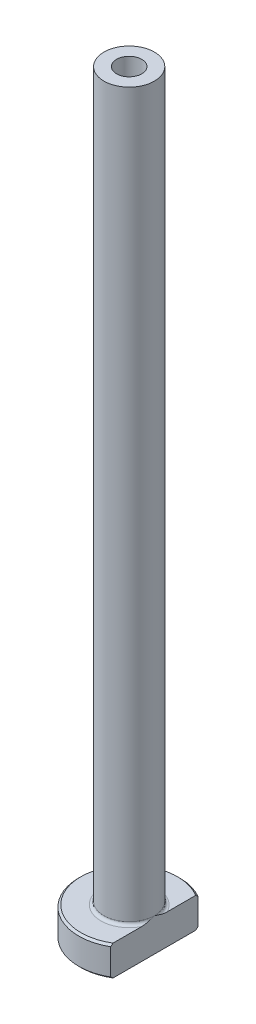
ISO-10303-21;
HEADER;
FILE_DESCRIPTION(('STEP AP214'),'2;1');
FILE_NAME('part.step','',(''),(''),'','','');
FILE_SCHEMA(('AUTOMOTIVE_DESIGN { 1 0 10303 214 1 1 1 1 }'));
ENDSEC;
DATA;
#1=APPLICATION_CONTEXT('core data for automotive mechanical design processes');
#2=APPLICATION_PROTOCOL_DEFINITION('international standard','automotive_design',2000,#1);
#3=PRODUCT_CONTEXT('',#1,'mechanical');
#4=PRODUCT('Part','Part','',(#3));
#5=PRODUCT_RELATED_PRODUCT_CATEGORY('part','',(#4));
#6=PRODUCT_DEFINITION_FORMATION('','',#4);
#7=PRODUCT_DEFINITION_CONTEXT('part definition',#1,'design');
#8=PRODUCT_DEFINITION('design','',#6,#7);
#9=PRODUCT_DEFINITION_SHAPE('','',#8);
#10=(LENGTH_UNIT() NAMED_UNIT(*) SI_UNIT(.MILLI.,.METRE.));
#11=(NAMED_UNIT(*) PLANE_ANGLE_UNIT() SI_UNIT($,.RADIAN.));
#12=(NAMED_UNIT(*) SI_UNIT($,.STERADIAN.) SOLID_ANGLE_UNIT());
#13=UNCERTAINTY_MEASURE_WITH_UNIT(LENGTH_MEASURE(1.E-05),#10,'distance_accuracy_value','');
#14=(GEOMETRIC_REPRESENTATION_CONTEXT(3) GLOBAL_UNCERTAINTY_ASSIGNED_CONTEXT((#13)) GLOBAL_UNIT_ASSIGNED_CONTEXT((#10,
#11,#12)) REPRESENTATION_CONTEXT('',''));
#15=CARTESIAN_POINT('',(0.,0.,0.));
#16=DIRECTION('',(0.,0.,1.));
#17=DIRECTION('',(1.,0.,0.));
#18=AXIS2_PLACEMENT_3D('',#15,#16,#17);
#19=CARTESIAN_POINT('',(0.,92.1876809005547,0.));
#20=DIRECTION('',(0.,1.,0.));
#21=DIRECTION('',(0.,0.,1.));
#22=AXIS2_PLACEMENT_3D('',#19,#20,#21);
#23=CYLINDRICAL_SURFACE('',#22,1.25000000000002);
#24=CARTESIAN_POINT('',(0.,75.,0.));
#25=DIRECTION('',(0.,1.,0.));
#26=DIRECTION('',(0.,0.,1.));
#27=AXIS2_PLACEMENT_3D('',#24,#25,#26);
#28=CIRCLE('',#27,1.25000000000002);
#29=CARTESIAN_POINT('',(0.,75.,1.25000000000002));
#30=VERTEX_POINT('',#29);
#31=EDGE_CURVE('E167',#30,#30,#28,.T.);
#32=ORIENTED_EDGE('',*,*,#31,.T.);
#33=EDGE_LOOP('',(#32));
#34=FACE_BOUND('',#33,.T.);
#35=CARTESIAN_POINT('',(0.,40.,0.));
#36=DIRECTION('',(0.,1.,0.));
#37=DIRECTION('',(0.,0.,1.));
#38=AXIS2_PLACEMENT_3D('',#35,#36,#37);
#39=CIRCLE('',#38,1.25000000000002);
#40=CARTESIAN_POINT('',(0.,40.,1.25000000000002));
#41=VERTEX_POINT('',#40);
#42=EDGE_CURVE('E170',#41,#41,#39,.T.);
#43=ORIENTED_EDGE('',*,*,#42,.F.);
#44=EDGE_LOOP('',(#43));
#45=FACE_BOUND('',#44,.T.);
#46=ADVANCED_FACE('F32',(#34,#45),#23,.F.);
#47=CARTESIAN_POINT('',(-1.25000000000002,75.,0.));
#48=DIRECTION('',(0.,1.,0.));
#49=DIRECTION('',(0.,0.,1.));
#50=AXIS2_PLACEMENT_3D('',#47,#48,#49);
#51=PLANE('',#50);
#52=CARTESIAN_POINT('',(0.,75.,0.));
#53=DIRECTION('',(0.,1.,0.));
#54=DIRECTION('',(0.,0.,1.));
#55=AXIS2_PLACEMENT_3D('',#52,#53,#54);
#56=CIRCLE('',#55,2.5);
#57=CARTESIAN_POINT('',(0.,75.,2.5));
#58=VERTEX_POINT('',#57);
#59=EDGE_CURVE('E174',#58,#58,#56,.T.);
#60=ORIENTED_EDGE('',*,*,#59,.T.);
#61=EDGE_LOOP('',(#60));
#62=FACE_BOUND('',#61,.T.);
#63=ORIENTED_EDGE('',*,*,#31,.F.);
#64=EDGE_LOOP('',(#63));
#65=FACE_BOUND('',#64,.T.);
#66=ADVANCED_FACE('F157',(#62,#65),#51,.T.);
#67=CARTESIAN_POINT('',(0.,92.1876809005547,0.));
#68=DIRECTION('',(0.,1.,0.));
#69=DIRECTION('',(0.,0.,1.));
#70=AXIS2_PLACEMENT_3D('',#67,#68,#69);
#71=CYLINDRICAL_SURFACE('',#70,2.49999999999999);
#72=CARTESIAN_POINT('',(0.,3.3,0.));
#73=DIRECTION('',(0.,1.,0.));
#74=DIRECTION('',(0.,0.,1.));
#75=AXIS2_PLACEMENT_3D('',#72,#73,#74);
#76=CIRCLE('',#75,2.49999999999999);
#77=CARTESIAN_POINT('',(2.49999999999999,3.3,0.));
#78=VERTEX_POINT('',#77);
#79=EDGE_CURVE('E180',#78,#78,#76,.T.);
#80=ORIENTED_EDGE('',*,*,#79,.T.);
#81=EDGE_LOOP('',(#80));
#82=FACE_BOUND('',#81,.T.);
#83=ORIENTED_EDGE('',*,*,#59,.F.);
#84=EDGE_LOOP('',(#83));
#85=FACE_BOUND('',#84,.T.);
#86=ADVANCED_FACE('F162',(#82,#85),#71,.T.);
#87=CARTESIAN_POINT('',(-2.49999999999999,3.,0.));
#88=DIRECTION('',(0.,1.,0.));
#89=DIRECTION('',(0.,0.,1.));
#90=AXIS2_PLACEMENT_3D('',#87,#88,#89);
#91=PLANE('',#90);
#92=DIRECTION('',(0.,0.,1.));
#93=VECTOR('',#92,1.);
#94=CARTESIAN_POINT('',(2.49999999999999,3.,0.));
#95=LINE('',#94,#93);
#96=CARTESIAN_POINT('',(2.5,3.,-4.09756024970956));
#97=VERTEX_POINT('',#96);
#98=CARTESIAN_POINT('',(2.49999999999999,3.,-1.26095202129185));
#99=VERTEX_POINT('',#98);
#100=EDGE_CURVE('E54',#97,#99,#95,.T.);
#101=ORIENTED_EDGE('',*,*,#100,.F.);
#102=CARTESIAN_POINT('',(0.,3.,0.));
#103=DIRECTION('',(0.,1.,0.));
#104=DIRECTION('',(0.,0.,1.));
#105=AXIS2_PLACEMENT_3D('',#102,#103,#104);
#106=CIRCLE('',#105,4.79999999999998);
#107=CARTESIAN_POINT('',(2.49999999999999,3.,4.09756024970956));
#108=VERTEX_POINT('',#107);
#109=EDGE_CURVE('E186',#97,#108,#106,.T.);
#110=ORIENTED_EDGE('',*,*,#109,.T.);
#111=CARTESIAN_POINT('',(2.49999999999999,3.,1.26095202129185));
#112=VERTEX_POINT('',#111);
#113=EDGE_CURVE('E134',#112,#108,#95,.T.);
#114=ORIENTED_EDGE('',*,*,#113,.F.);
#115=CARTESIAN_POINT('',(0.,3.,0.));
#116=DIRECTION('',(0.,1.,0.));
#117=DIRECTION('',(0.,0.,1.));
#118=AXIS2_PLACEMENT_3D('',#115,#116,#117);
#119=CIRCLE('',#118,2.79999999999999);
#120=EDGE_CURVE('E183',#112,#99,#119,.F.);
#121=ORIENTED_EDGE('',*,*,#120,.T.);
#122=EDGE_LOOP('',(#101,#110,#114,#121));
#123=FACE_BOUND('',#122,.T.);
#124=ADVANCED_FACE('F197',(#123),#91,.T.);
#125=CARTESIAN_POINT('',(0.,92.1876809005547,0.));
#126=DIRECTION('',(0.,1.,0.));
#127=DIRECTION('',(0.,0.,1.));
#128=AXIS2_PLACEMENT_3D('',#125,#126,#127);
#129=CYLINDRICAL_SURFACE('',#128,4.99999999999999);
#130=DIRECTION('',(0.,-1.,0.));
#131=VECTOR('',#130,1.);
#132=CARTESIAN_POINT('',(2.49999999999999,75.,4.33012701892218));
#133=LINE('',#132,#131);
#134=CARTESIAN_POINT('',(2.49999999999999,2.79999999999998,4.33012701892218));
#135=VERTEX_POINT('',#134);
#136=CARTESIAN_POINT('',(2.49999999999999,0.199999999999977,4.33012701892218));
#137=VERTEX_POINT('',#136);
#138=EDGE_CURVE('E82',#135,#137,#133,.T.);
#139=ORIENTED_EDGE('',*,*,#138,.F.);
#140=CARTESIAN_POINT('',(0.,2.79999999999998,0.));
#141=DIRECTION('',(0.,1.,0.));
#142=DIRECTION('',(0.,0.,1.));
#143=AXIS2_PLACEMENT_3D('',#140,#141,#142);
#144=CIRCLE('',#143,4.99999999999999);
#145=CARTESIAN_POINT('',(2.5,2.79999999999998,-4.33012701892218));
#146=VERTEX_POINT('',#145);
#147=EDGE_CURVE('E95',#135,#146,#144,.F.);
#148=ORIENTED_EDGE('',*,*,#147,.T.);
#149=DIRECTION('',(0.,-1.,0.));
#150=VECTOR('',#149,1.);
#151=CARTESIAN_POINT('',(2.5,75.,-4.33012701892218));
#152=LINE('',#151,#150);
#153=CARTESIAN_POINT('',(2.5,0.199999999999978,-4.33012701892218));
#154=VERTEX_POINT('',#153);
#155=EDGE_CURVE('E192',#146,#154,#152,.T.);
#156=ORIENTED_EDGE('',*,*,#155,.T.);
#157=CARTESIAN_POINT('',(0.,0.199999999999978,0.));
#158=DIRECTION('',(0.,-1.,0.));
#159=DIRECTION('',(0.,0.,-1.));
#160=AXIS2_PLACEMENT_3D('',#157,#158,#159);
#161=CIRCLE('',#160,4.99999999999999);
#162=EDGE_CURVE('E98',#154,#137,#161,.F.);
#163=ORIENTED_EDGE('',*,*,#162,.T.);
#164=EDGE_LOOP('',(#139,#148,#156,#163));
#165=FACE_BOUND('',#164,.T.);
#166=ADVANCED_FACE('F190',(#165),#129,.T.);
#167=CARTESIAN_POINT('',(-4.99999999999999,0.,0.));
#168=DIRECTION('',(0.,-1.,0.));
#169=DIRECTION('',(0.,0.,-1.));
#170=AXIS2_PLACEMENT_3D('',#167,#168,#169);
#171=PLANE('',#170);
#172=CARTESIAN_POINT('',(0.,0.,0.));
#173=DIRECTION('',(0.,-1.,0.));
#174=DIRECTION('',(0.,0.,-1.));
#175=AXIS2_PLACEMENT_3D('',#172,#173,#174);
#176=CIRCLE('',#175,1.99999999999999);
#177=CARTESIAN_POINT('',(0.,0.,-1.99999999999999));
#178=VERTEX_POINT('',#177);
#179=EDGE_CURVE('E40',#178,#178,#176,.F.);
#180=ORIENTED_EDGE('',*,*,#179,.T.);
#181=EDGE_LOOP('',(#180));
#182=FACE_BOUND('',#181,.T.);
#183=DIRECTION('',(0.,0.,-1.));
#184=VECTOR('',#183,1.);
#185=CARTESIAN_POINT('',(2.49999999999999,0.,4.33012701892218));
#186=LINE('',#185,#184);
#187=CARTESIAN_POINT('',(2.49999999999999,0.,4.09756024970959));
#188=VERTEX_POINT('',#187);
#189=CARTESIAN_POINT('',(2.5,0.,-4.09756024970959));
#190=VERTEX_POINT('',#189);
#191=EDGE_CURVE('E47',#188,#190,#186,.T.);
#192=ORIENTED_EDGE('',*,*,#191,.F.);
#193=CARTESIAN_POINT('',(0.,0.,0.));
#194=DIRECTION('',(0.,-1.,0.));
#195=DIRECTION('',(0.,0.,-1.));
#196=AXIS2_PLACEMENT_3D('',#193,#194,#195);
#197=CIRCLE('',#196,4.80000000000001);
#198=EDGE_CURVE('E92',#188,#190,#197,.T.);
#199=ORIENTED_EDGE('',*,*,#198,.T.);
#200=EDGE_LOOP('',(#192,#199));
#201=FACE_BOUND('',#200,.T.);
#202=ADVANCED_FACE('F91',(#182,#201),#171,.T.);
#203=CARTESIAN_POINT('',(0.,92.1876809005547,0.));
#204=DIRECTION('',(0.,1.,0.));
#205=DIRECTION('',(0.,0.,1.));
#206=AXIS2_PLACEMENT_3D('',#203,#204,#205);
#207=CYLINDRICAL_SURFACE('',#206,1.49999999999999);
#208=CARTESIAN_POINT('',(0.,0.5,0.));
#209=DIRECTION('',(0.,-1.,0.));
#210=DIRECTION('',(0.,0.,-1.));
#211=AXIS2_PLACEMENT_3D('',#208,#209,#210);
#212=CIRCLE('',#211,1.49999999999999);
#213=CARTESIAN_POINT('',(0.,0.5,-1.49999999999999));
#214=VERTEX_POINT('',#213);
#215=EDGE_CURVE('E11',#214,#214,#212,.T.);
#216=ORIENTED_EDGE('',*,*,#215,.T.);
#217=EDGE_LOOP('',(#216));
#218=FACE_BOUND('',#217,.T.);
#219=CARTESIAN_POINT('',(0.,28.,0.));
#220=DIRECTION('',(0.,1.,0.));
#221=DIRECTION('',(0.,0.,1.));
#222=AXIS2_PLACEMENT_3D('',#219,#220,#221);
#223=CIRCLE('',#222,1.49999999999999);
#224=CARTESIAN_POINT('',(0.,28.,1.49999999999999));
#225=VERTEX_POINT('',#224);
#226=EDGE_CURVE('E172',#225,#225,#223,.T.);
#227=ORIENTED_EDGE('',*,*,#226,.T.);
#228=EDGE_LOOP('',(#227));
#229=FACE_BOUND('',#228,.T.);
#230=ADVANCED_FACE('F215',(#218,#229),#207,.F.);
#231=CARTESIAN_POINT('',(0.,28.,0.));
#232=DIRECTION('',(0.,-1.,0.));
#233=DIRECTION('',(0.,0.,-1.));
#234=AXIS2_PLACEMENT_3D('',#231,#232,#233);
#235=CONICAL_SURFACE('',#234,1.49999999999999,0.0208303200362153);
#236=ORIENTED_EDGE('',*,*,#42,.T.);
#237=EDGE_LOOP('',(#236));
#238=FACE_BOUND('',#237,.T.);
#239=ORIENTED_EDGE('',*,*,#226,.F.);
#240=EDGE_LOOP('',(#239));
#241=FACE_BOUND('',#240,.T.);
#242=ADVANCED_FACE('F111',(#238,#241),#235,.F.);
#243=CARTESIAN_POINT('',(0.,3.3,0.));
#244=DIRECTION('',(0.,1.,0.));
#245=DIRECTION('',(0.,0.,1.));
#246=AXIS2_PLACEMENT_3D('',#243,#244,#245);
#247=TOROIDAL_SURFACE('',#246,2.79999999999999,0.3);
#248=ORIENTED_EDGE('',*,*,#120,.F.);
#249=CARTESIAN_POINT('',(2.49999999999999,3.3,0.));
#250=CARTESIAN_POINT('',(2.49999999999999,3.3000006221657,-4.84264874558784E-11));
#251=CARTESIAN_POINT('',(2.49999999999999,3.30000124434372,1.59620946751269E-07));
#252=CARTESIAN_POINT('',(2.49999999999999,3.30000243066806,6.45477700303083E-07));
#253=CARTESIAN_POINT('',(2.49999999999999,3.30000299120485,9.7848036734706E-07));
#254=CARTESIAN_POINT('',(2.49999999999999,3.30000411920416,1.774719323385E-06));
#255=CARTESIAN_POINT('',(2.49999999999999,3.30000467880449,2.24902086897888E-06));
#256=CARTESIAN_POINT('',(2.49999999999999,3.3000057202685,3.25953613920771E-06));
#257=CARTESIAN_POINT('',(2.49999999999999,3.30000620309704,3.7948067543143E-06));
#258=CARTESIAN_POINT('',(2.49999999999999,3.30000787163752,5.75794533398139E-06));
#259=CARTESIAN_POINT('',(2.49999999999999,3.30000896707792,7.26424002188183E-06));
#260=CARTESIAN_POINT('',(2.49999999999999,3.30001087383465,1.03361117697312E-05));
#261=CARTESIAN_POINT('',(2.49999999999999,3.30001169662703,1.18949488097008E-05));
#262=CARTESIAN_POINT('',(2.49999999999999,3.30001489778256,1.81400834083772E-05));
#263=CARTESIAN_POINT('',(2.49999999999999,3.30001712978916,2.29062155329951E-05));
#264=CARTESIAN_POINT('',(2.49999999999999,3.30002067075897,3.21793840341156E-05));
#265=CARTESIAN_POINT('',(2.49999999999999,3.30002205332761,3.66588963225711E-05));
#266=CARTESIAN_POINT('',(2.49999999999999,3.30002810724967,5.61718364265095E-05));
#267=CARTESIAN_POINT('',(2.49999999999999,3.30003284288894,7.11735811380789E-05));
#268=CARTESIAN_POINT('',(2.49999999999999,3.30004025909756,9.89920262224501E-05));
#269=CARTESIAN_POINT('',(2.49999999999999,3.30004315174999,0.000111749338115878));
#270=CARTESIAN_POINT('',(2.5,3.30006652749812,0.00020624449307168));
#271=CARTESIAN_POINT('',(2.5,3.3000969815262,0.000285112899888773));
#272=CARTESIAN_POINT('',(2.49999999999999,3.30021213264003,0.000594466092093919));
#273=CARTESIAN_POINT('',(2.49999999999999,3.30028938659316,0.0008269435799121));
#274=CARTESIAN_POINT('',(2.5,3.30059681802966,0.00173885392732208));
#275=CARTESIAN_POINT('',(2.5,3.30083479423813,0.00241625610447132));
#276=CARTESIAN_POINT('',(2.49999999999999,3.30181198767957,0.00521069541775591));
#277=CARTESIAN_POINT('',(2.49999999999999,3.30254240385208,0.00732996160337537));
#278=CARTESIAN_POINT('',(2.50000000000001,3.31226043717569,0.0355096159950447));
#279=CARTESIAN_POINT('',(2.5,3.32130808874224,0.0615551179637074));
#280=CARTESIAN_POINT('',(2.49999999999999,3.33896212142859,0.112677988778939));
#281=CARTESIAN_POINT('',(2.49999999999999,3.34757212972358,0.137754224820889));
#282=CARTESIAN_POINT('',(2.5,3.36573068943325,0.190981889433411));
#283=CARTESIAN_POINT('',(2.5,3.37526654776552,0.219137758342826));
#284=CARTESIAN_POINT('',(2.49999999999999,3.3942286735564,0.275816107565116));
#285=CARTESIAN_POINT('',(2.5,3.40365272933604,0.304339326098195));
#286=CARTESIAN_POINT('',(2.5,3.42641697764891,0.374416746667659));
#287=CARTESIAN_POINT('',(2.5,3.43959811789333,0.416023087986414));
#288=CARTESIAN_POINT('',(2.5,3.46479157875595,0.498481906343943));
#289=CARTESIAN_POINT('',(2.5,3.47682455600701,0.539328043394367));
#290=CARTESIAN_POINT('',(2.5,3.50224427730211,0.629981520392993));
#291=CARTESIAN_POINT('',(2.5,3.51538048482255,0.679860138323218));
#292=CARTESIAN_POINT('',(2.5,3.53964074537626,0.780511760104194));
#293=CARTESIAN_POINT('',(2.5,3.55074877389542,0.831288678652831));
#294=CARTESIAN_POINT('',(2.5,3.57087054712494,0.93706346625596));
#295=CARTESIAN_POINT('',(2.5,3.57967623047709,0.992102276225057));
#296=CARTESIAN_POINT('',(2.5,3.59301148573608,1.10256024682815));
#297=CARTESIAN_POINT('',(2.5,3.59755297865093,1.15797790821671));
#298=CARTESIAN_POINT('',(2.5,3.60093314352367,1.26786705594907));
#299=CARTESIAN_POINT('',(2.5,3.59989366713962,1.32233291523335));
#300=CARTESIAN_POINT('',(2.5,3.59277279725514,1.40310062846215));
#301=CARTESIAN_POINT('',(2.5,3.58952137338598,1.42965222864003));
#302=CARTESIAN_POINT('',(2.5,3.58085857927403,1.48239078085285));
#303=CARTESIAN_POINT('',(2.5,3.57544928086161,1.50857805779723));
#304=CARTESIAN_POINT('',(2.5,3.56298810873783,1.55658799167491));
#305=CARTESIAN_POINT('',(2.5,3.55628200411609,1.57849902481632));
#306=CARTESIAN_POINT('',(2.5,3.54055393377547,1.62160292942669));
#307=CARTESIAN_POINT('',(2.5,3.53152220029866,1.64279233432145));
#308=CARTESIAN_POINT('',(2.5,3.51057199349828,1.68404469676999));
#309=CARTESIAN_POINT('',(2.5,3.49862012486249,1.70409105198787));
#310=CARTESIAN_POINT('',(2.5,3.47134074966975,1.74172093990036));
#311=CARTESIAN_POINT('',(2.5,3.45603127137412,1.75931683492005));
#312=CARTESIAN_POINT('',(2.5,3.42979930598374,1.7829707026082));
#313=CARTESIAN_POINT('',(2.5,3.42024268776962,1.79054141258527));
#314=CARTESIAN_POINT('',(2.5,3.40009035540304,1.80416997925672));
#315=CARTESIAN_POINT('',(2.5,3.38949499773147,1.81022835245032));
#316=CARTESIAN_POINT('',(2.5,3.36727740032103,1.82047087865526));
#317=CARTESIAN_POINT('',(2.5,3.35564531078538,1.82463409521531));
#318=CARTESIAN_POINT('',(2.5,3.33178837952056,1.83058442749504));
#319=CARTESIAN_POINT('',(2.5,3.31956435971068,1.83237474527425));
#320=CARTESIAN_POINT('',(2.5,3.29665736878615,1.83331852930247));
#321=CARTESIAN_POINT('',(2.5,3.28598670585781,1.83279233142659));
#322=CARTESIAN_POINT('',(2.5,3.26490749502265,1.82986307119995));
#323=CARTESIAN_POINT('',(2.5,3.254498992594,1.82745968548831));
#324=CARTESIAN_POINT('',(2.5,3.23467098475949,1.8211125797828));
#325=CARTESIAN_POINT('',(2.5,3.22522816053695,1.81724026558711));
#326=CARTESIAN_POINT('',(2.5,3.20699535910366,1.80819497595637));
#327=CARTESIAN_POINT('',(2.5,3.19820556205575,1.8030216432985));
#328=CARTESIAN_POINT('',(2.5,3.17663162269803,1.78842115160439));
#329=CARTESIAN_POINT('',(2.5,3.16436228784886,1.77823293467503));
#330=CARTESIAN_POINT('',(2.5,3.14157828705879,1.75604629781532));
#331=CARTESIAN_POINT('',(2.5,3.13106906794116,1.74404246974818));
#332=CARTESIAN_POINT('',(2.5,3.10600520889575,1.71142114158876));
#333=CARTESIAN_POINT('',(2.5,3.09267476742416,1.68986887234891));
#334=CARTESIAN_POINT('',(2.5,3.06940323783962,1.64508572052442));
#335=CARTESIAN_POINT('',(2.5,3.0594631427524,1.62185434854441));
#336=CARTESIAN_POINT('',(2.5,3.03545750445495,1.55546754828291));
#337=CARTESIAN_POINT('',(2.5,3.02444022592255,1.51122187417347));
#338=CARTESIAN_POINT('',(2.5,3.00863926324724,1.42119777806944));
#339=CARTESIAN_POINT('',(2.5,3.00393876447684,1.37540689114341));
#340=CARTESIAN_POINT('',(2.5,2.99924212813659,1.28072198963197));
#341=CARTESIAN_POINT('',(2.5,2.99956098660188,1.23181420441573));
#342=CARTESIAN_POINT('',(2.5,3.00436098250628,1.13410944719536));
#343=CARTESIAN_POINT('',(2.5,3.00885327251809,1.08531312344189));
#344=CARTESIAN_POINT('',(2.5,3.02074191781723,0.990773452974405));
#345=CARTESIAN_POINT('',(2.5,3.02796792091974,0.945007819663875));
#346=CARTESIAN_POINT('',(2.5,3.04465555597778,0.854199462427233));
#347=CARTESIAN_POINT('',(2.5,3.05410250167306,0.809153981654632));
#348=CARTESIAN_POINT('',(2.5,3.07710029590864,0.709411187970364));
#349=CARTESIAN_POINT('',(2.5,3.0910963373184,0.654817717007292));
#350=CARTESIAN_POINT('',(2.5,3.12140740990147,0.544863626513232));
#351=CARTESIAN_POINT('',(2.5,3.13777040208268,0.489516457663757));
#352=CARTESIAN_POINT('',(2.5,3.16649540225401,0.396740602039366));
#353=CARTESIAN_POINT('',(2.49999999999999,3.17848130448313,0.359193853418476));
#354=CARTESIAN_POINT('',(2.5,3.20280507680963,0.284651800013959));
#355=CARTESIAN_POINT('',(2.5,3.21513791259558,0.247654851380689));
#356=CARTESIAN_POINT('',(2.49999999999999,3.23873713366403,0.177767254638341));
#357=CARTESIAN_POINT('',(2.49999999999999,3.24997409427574,0.144866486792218));
#358=CARTESIAN_POINT('',(2.5,3.27307149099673,0.0777985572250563));
#359=CARTESIAN_POINT('',(2.50000000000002,3.28493883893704,0.0436336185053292));
#360=CARTESIAN_POINT('',(2.49999999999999,3.29745794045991,0.00732879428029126));
#361=CARTESIAN_POINT('',(2.49999999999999,3.29818879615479,0.00520838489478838));
#362=CARTESIAN_POINT('',(2.5,3.29916610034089,0.00241367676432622));
#363=CARTESIAN_POINT('',(2.5,3.2994037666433,0.00173715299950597));
#364=CARTESIAN_POINT('',(2.49999999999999,3.29971082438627,0.000826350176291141));
#365=CARTESIAN_POINT('',(2.49999999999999,3.29978800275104,0.000594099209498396));
#366=CARTESIAN_POINT('',(2.5,3.29990305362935,0.000285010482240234));
#367=CARTESIAN_POINT('',(2.5,3.29993349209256,0.000206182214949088));
#368=CARTESIAN_POINT('',(2.49999999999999,3.29995685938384,0.000111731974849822));
#369=CARTESIAN_POINT('',(2.49999999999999,3.29995975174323,9.89774252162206E-05));
#370=CARTESIAN_POINT('',(2.49999999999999,3.29996716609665,7.11651824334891E-05));
#371=CARTESIAN_POINT('',(2.49999999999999,3.29997189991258,5.61668050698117E-05));
#372=CARTESIAN_POINT('',(2.49999999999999,3.29997795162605,3.66576298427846E-05));
#373=CARTESIAN_POINT('',(2.49999999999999,3.2999793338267,3.21785213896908E-05));
#374=CARTESIAN_POINT('',(2.49999999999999,3.29998287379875,2.29061348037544E-05));
#375=CARTESIAN_POINT('',(2.49999999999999,3.29998510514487,1.81403640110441E-05));
#376=CARTESIAN_POINT('',(2.49999999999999,3.29998830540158,1.18955808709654E-05));
#377=CARTESIAN_POINT('',(2.49999999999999,3.29998912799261,1.03367747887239E-05));
#378=CARTESIAN_POINT('',(2.49999999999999,3.29999103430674,7.26492657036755E-06));
#379=CARTESIAN_POINT('',(2.49999999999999,3.29999212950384,5.75862173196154E-06));
#380=CARTESIAN_POINT('',(2.49999999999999,3.29999379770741,3.79542390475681E-06));
#381=CARTESIAN_POINT('',(2.49999999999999,3.29999428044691,3.26012684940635E-06));
#382=CARTESIAN_POINT('',(2.49999999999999,3.2999953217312,2.24954267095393E-06));
#383=CARTESIAN_POINT('',(2.49999999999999,3.2999958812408,1.77519838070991E-06));
#384=CARTESIAN_POINT('',(2.49999999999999,3.29999700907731,9.78856700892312E-07));
#385=CARTESIAN_POINT('',(2.49999999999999,3.29999756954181,6.45796746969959E-07));
#386=CARTESIAN_POINT('',(2.49999999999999,3.29999875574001,1.59799482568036E-07));
#387=CARTESIAN_POINT('',(2.49999999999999,3.29999937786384,4.84246889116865E-11));
#388=CARTESIAN_POINT('',(2.49999999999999,3.3,0.));
#389=B_SPLINE_CURVE_WITH_KNOTS('',3,(#249,#250,#251,#252,#253,#254,#255,#256,#257,#258,#259,
#260,#261,#262,#263,#264,#265,#266,#267,#268,#269,#270,#271,#272,#273,#274,#275,#276,#277,#278,
#279,#280,#281,#282,#283,#284,#285,#286,#287,#288,#289,#290,#291,#292,#293,#294,#295,#296,#297,
#298,#299,#300,#301,#302,#303,#304,#305,#306,#307,#308,#309,#310,#311,#312,#313,#314,#315,#316,
#317,#318,#319,#320,#321,#322,#323,#324,#325,#326,#327,#328,#329,#330,#331,#332,#333,#334,#335,
#336,#337,#338,#339,#340,#341,#342,#343,#344,#345,#346,#347,#348,#349,#350,#351,#352,#353,#354,
#355,#356,#357,#358,#359,#360,#361,#362,#363,#364,#365,#366,#367,#368,#369,#370,#371,#372,#373,
#374,#375,#376,#377,#378,#379,#380,#381,#382,#383,#384,#385,#386,#387,#388),.UNSPECIFIED.,.T.,
.F.,(4,2,2,2,2,2,2,2,2,2,2,2,2,2,2,2,2,2,2,2,2,2,2,2,2,2,2,2,2,2,2,2,2,2,2,2,2,2,2,2,2,2,2,2,2,
2,2,2,2,2,2,2,2,2,2,2,2,2,2,2,2,2,2,2,2,2,2,2,2,4),(0.,1.86789357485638E-06,
3.81549845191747E-06,6.0061078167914E-06,8.16653364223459E-06,1.37285636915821E-05,
1.90122229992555E-05,3.47597349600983E-05,4.88082693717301E-05,9.59978501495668E-05,
0.000135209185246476,0.000388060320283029,0.00112364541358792,0.00327678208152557,
0.0100024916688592,0.0927120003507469,0.172253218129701,0.261432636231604,0.351551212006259,
0.482477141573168,0.610212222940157,0.764915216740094,0.920792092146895,1.08787897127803,
1.2544973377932,1.41749285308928,1.49767530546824,1.57778095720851,1.64642481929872,
1.7153618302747,1.78512750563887,1.85452737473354,1.89099315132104,1.92744645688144,
1.96429324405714,2.00109025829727,2.03297105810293,2.06485735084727,2.09535926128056,
2.12586955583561,2.17344034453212,2.22115572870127,2.29675134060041,2.3723690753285,
2.50839721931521,2.64619971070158,2.79268284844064,2.93955855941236,3.07848421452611,
3.21651583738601,3.38554045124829,3.55865938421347,3.67689643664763,3.79388863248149,
3.89819085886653,4.00668323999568,4.01341261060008,4.01556295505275,4.01629782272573,
4.01655054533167,4.01658974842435,4.01663692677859,4.01665097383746,4.01666671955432,
4.01667200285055,4.01667756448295,4.01667972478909,4.01668191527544,4.01668386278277,
4.01668573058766),.UNSPECIFIED.);
#390=EDGE_CURVE('E126',#112,#78,#389,.T.);
#391=ORIENTED_EDGE('',*,*,#390,.T.);
#392=ORIENTED_EDGE('',*,*,#79,.F.);
#393=CARTESIAN_POINT('',(2.49999999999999,3.3,0.));
#394=CARTESIAN_POINT('',(2.49999999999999,3.2999993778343,4.84269754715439E-11));
#395=CARTESIAN_POINT('',(2.49999999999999,3.29999875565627,-1.59620946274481E-07));
#396=CARTESIAN_POINT('',(2.49999999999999,3.29999756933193,-6.45477699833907E-07));
#397=CARTESIAN_POINT('',(2.49999999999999,3.29999700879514,-9.78480366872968E-07));
#398=CARTESIAN_POINT('',(2.49999999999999,3.29999588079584,-1.7747193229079E-06));
#399=CARTESIAN_POINT('',(2.49999999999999,3.29999532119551,-2.24902086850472E-06));
#400=CARTESIAN_POINT('',(2.49999999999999,3.29999427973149,-3.25953613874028E-06));
#401=CARTESIAN_POINT('',(2.49999999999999,3.29999379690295,-3.79480675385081E-06));
#402=CARTESIAN_POINT('',(2.49999999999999,3.29999212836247,-5.75794533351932E-06));
#403=CARTESIAN_POINT('',(2.49999999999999,3.29999103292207,-7.26424002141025E-06));
#404=CARTESIAN_POINT('',(2.49999999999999,3.29998912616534,-1.03361117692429E-05));
#405=CARTESIAN_POINT('',(2.49999999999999,3.29998830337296,-1.18949488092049E-05));
#406=CARTESIAN_POINT('',(2.49999999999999,3.29998510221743,-1.81400834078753E-05));
#407=CARTESIAN_POINT('',(2.49999999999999,3.29998287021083,-2.29062155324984E-05));
#408=CARTESIAN_POINT('',(2.49999999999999,3.29997932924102,-3.21793840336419E-05));
#409=CARTESIAN_POINT('',(2.49999999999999,3.29997794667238,-3.66588963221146E-05));
#410=CARTESIAN_POINT('',(2.49999999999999,3.29997189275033,-5.61718364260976E-05));
#411=CARTESIAN_POINT('',(2.49999999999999,3.29996715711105,-7.11735811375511E-05));
#412=CARTESIAN_POINT('',(2.49999999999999,3.29995974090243,-9.89920262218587E-05));
#413=CARTESIAN_POINT('',(2.49999999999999,3.29995684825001,-0.000111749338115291));
#414=CARTESIAN_POINT('',(2.5,3.29993347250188,-0.000206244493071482));
#415=CARTESIAN_POINT('',(2.5,3.2999030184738,-0.000285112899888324));
#416=CARTESIAN_POINT('',(2.49999999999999,3.29978786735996,-0.000594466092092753));
#417=CARTESIAN_POINT('',(2.49999999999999,3.29971061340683,-0.000826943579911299));
#418=CARTESIAN_POINT('',(2.5,3.29940318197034,-0.00173885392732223));
#419=CARTESIAN_POINT('',(2.5,3.29916520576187,-0.00241625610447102));
#420=CARTESIAN_POINT('',(2.49999999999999,3.29818801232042,-0.00521069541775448));
#421=CARTESIAN_POINT('',(2.49999999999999,3.29745759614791,-0.00732996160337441));
#422=CARTESIAN_POINT('',(2.50000000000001,3.28773956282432,-0.0355096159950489));
#423=CARTESIAN_POINT('',(2.5,3.27869191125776,-0.061555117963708));
#424=CARTESIAN_POINT('',(2.49999999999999,3.2610378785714,-0.112677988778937));
#425=CARTESIAN_POINT('',(2.49999999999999,3.25242787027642,-0.137754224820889));
#426=CARTESIAN_POINT('',(2.5,3.23426931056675,-0.190981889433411));
#427=CARTESIAN_POINT('',(2.5,3.22473345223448,-0.219137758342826));
#428=CARTESIAN_POINT('',(2.49999999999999,3.20577132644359,-0.275816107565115));
#429=CARTESIAN_POINT('',(2.5,3.19634727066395,-0.304339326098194));
#430=CARTESIAN_POINT('',(2.5,3.17358302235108,-0.374416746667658));
#431=CARTESIAN_POINT('',(2.5,3.16040188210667,-0.416023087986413));
#432=CARTESIAN_POINT('',(2.5,3.13520842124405,-0.498481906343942));
#433=CARTESIAN_POINT('',(2.5,3.12317544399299,-0.539328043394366));
#434=CARTESIAN_POINT('',(2.5,3.09775572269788,-0.629981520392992));
#435=CARTESIAN_POINT('',(2.5,3.08461951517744,-0.679860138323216));
#436=CARTESIAN_POINT('',(2.5,3.06035925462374,-0.780511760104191));
#437=CARTESIAN_POINT('',(2.5,3.04925122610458,-0.831288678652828));
#438=CARTESIAN_POINT('',(2.5,3.02912945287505,-0.937063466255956));
#439=CARTESIAN_POINT('',(2.5,3.02032376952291,-0.992102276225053));
#440=CARTESIAN_POINT('',(2.5,3.00698851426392,-1.10256024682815));
#441=CARTESIAN_POINT('',(2.5,3.00244702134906,-1.1579779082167));
#442=CARTESIAN_POINT('',(2.5,2.99906685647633,-1.26786705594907));
#443=CARTESIAN_POINT('',(2.5,3.00010633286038,-1.32233291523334));
#444=CARTESIAN_POINT('',(2.5,3.00722720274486,-1.40310062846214));
#445=CARTESIAN_POINT('',(2.5,3.01047862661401,-1.42965222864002));
#446=CARTESIAN_POINT('',(2.5,3.01914142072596,-1.48239078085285));
#447=CARTESIAN_POINT('',(2.5,3.02455071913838,-1.50857805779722));
#448=CARTESIAN_POINT('',(2.5,3.03701189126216,-1.5565879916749));
#449=CARTESIAN_POINT('',(2.5,3.04371799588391,-1.57849902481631));
#450=CARTESIAN_POINT('',(2.5,3.05944606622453,-1.62160292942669));
#451=CARTESIAN_POINT('',(2.5,3.06847779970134,-1.64279233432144));
#452=CARTESIAN_POINT('',(2.5,3.08942800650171,-1.68404469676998));
#453=CARTESIAN_POINT('',(2.5,3.1013798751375,-1.70409105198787));
#454=CARTESIAN_POINT('',(2.5,3.12865925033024,-1.74172093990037));
#455=CARTESIAN_POINT('',(2.5,3.14396872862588,-1.75931683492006));
#456=CARTESIAN_POINT('',(2.5,3.17020069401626,-1.7829707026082));
#457=CARTESIAN_POINT('',(2.5,3.17975731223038,-1.79054141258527));
#458=CARTESIAN_POINT('',(2.5,3.19990964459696,-1.80416997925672));
#459=CARTESIAN_POINT('',(2.5,3.21050500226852,-1.81022835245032));
#460=CARTESIAN_POINT('',(2.5,3.23272259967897,-1.82047087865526));
#461=CARTESIAN_POINT('',(2.5,3.24435468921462,-1.82463409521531));
#462=CARTESIAN_POINT('',(2.5,3.26821162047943,-1.83058442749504));
#463=CARTESIAN_POINT('',(2.5,3.28043564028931,-1.83237474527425));
#464=CARTESIAN_POINT('',(2.5,3.30334263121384,-1.83331852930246));
#465=CARTESIAN_POINT('',(2.5,3.31401329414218,-1.83279233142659));
#466=CARTESIAN_POINT('',(2.5,3.33509250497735,-1.82986307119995));
#467=CARTESIAN_POINT('',(2.5,3.345501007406,-1.82745968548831));
#468=CARTESIAN_POINT('',(2.5,3.36532901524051,-1.8211125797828));
#469=CARTESIAN_POINT('',(2.5,3.37477183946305,-1.81724026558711));
#470=CARTESIAN_POINT('',(2.5,3.39300464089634,-1.80819497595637));
#471=CARTESIAN_POINT('',(2.5,3.40179443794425,-1.8030216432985));
#472=CARTESIAN_POINT('',(2.5,3.42336837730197,-1.78842115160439));
#473=CARTESIAN_POINT('',(2.5,3.43563771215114,-1.77823293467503));
#474=CARTESIAN_POINT('',(2.5,3.45842171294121,-1.75604629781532));
#475=CARTESIAN_POINT('',(2.5,3.46893093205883,-1.74404246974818));
#476=CARTESIAN_POINT('',(2.5,3.49399479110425,-1.71142114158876));
#477=CARTESIAN_POINT('',(2.5,3.50732523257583,-1.68986887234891));
#478=CARTESIAN_POINT('',(2.5,3.53059676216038,-1.64508572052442));
#479=CARTESIAN_POINT('',(2.5,3.5405368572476,-1.6218543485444));
#480=CARTESIAN_POINT('',(2.5,3.56454249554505,-1.5554675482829));
#481=CARTESIAN_POINT('',(2.5,3.57555977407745,-1.51122187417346));
#482=CARTESIAN_POINT('',(2.5,3.59136073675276,-1.42119777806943));
#483=CARTESIAN_POINT('',(2.5,3.59606123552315,-1.37540689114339));
#484=CARTESIAN_POINT('',(2.5,3.6007578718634,-1.28072198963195));
#485=CARTESIAN_POINT('',(2.5,3.60043901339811,-1.23181420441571));
#486=CARTESIAN_POINT('',(2.5,3.59563901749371,-1.13410944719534));
#487=CARTESIAN_POINT('',(2.5,3.5911467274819,-1.08531312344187));
#488=CARTESIAN_POINT('',(2.5,3.57925808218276,-0.99077345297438));
#489=CARTESIAN_POINT('',(2.5,3.57203207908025,-0.945007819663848));
#490=CARTESIAN_POINT('',(2.5,3.55534444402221,-0.854199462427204));
#491=CARTESIAN_POINT('',(2.5,3.54589749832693,-0.809153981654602));
#492=CARTESIAN_POINT('',(2.5,3.52289970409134,-0.709411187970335));
#493=CARTESIAN_POINT('',(2.5,3.50890366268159,-0.654817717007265));
#494=CARTESIAN_POINT('',(2.5,3.47859259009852,-0.54486362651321));
#495=CARTESIAN_POINT('',(2.5,3.46222959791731,-0.489516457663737));
#496=CARTESIAN_POINT('',(2.5,3.43350459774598,-0.39674060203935));
#497=CARTESIAN_POINT('',(2.49999999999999,3.42151869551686,-0.359193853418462));
#498=CARTESIAN_POINT('',(2.5,3.39719492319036,-0.284651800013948));
#499=CARTESIAN_POINT('',(2.5,3.38486208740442,-0.247654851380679));
#500=CARTESIAN_POINT('',(2.49999999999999,3.36126286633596,-0.177767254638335));
#501=CARTESIAN_POINT('',(2.49999999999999,3.35002590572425,-0.144866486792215));
#502=CARTESIAN_POINT('',(2.5,3.32692850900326,-0.077798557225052));
#503=CARTESIAN_POINT('',(2.50000000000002,3.31506116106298,-0.0436336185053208));
#504=CARTESIAN_POINT('',(2.49999999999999,3.30254205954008,-0.00732879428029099));
#505=CARTESIAN_POINT('',(2.49999999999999,3.3018112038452,-0.00520838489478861));
#506=CARTESIAN_POINT('',(2.5,3.30083389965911,-0.0024136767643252));
#507=CARTESIAN_POINT('',(2.5,3.3005962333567,-0.0017371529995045));
#508=CARTESIAN_POINT('',(2.49999999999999,3.30028917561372,-0.000826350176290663));
#509=CARTESIAN_POINT('',(2.49999999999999,3.30021199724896,-0.00059409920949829));
#510=CARTESIAN_POINT('',(2.5,3.30009694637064,-0.000285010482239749));
#511=CARTESIAN_POINT('',(2.5,3.30006650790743,-0.000206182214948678));
#512=CARTESIAN_POINT('',(2.49999999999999,3.30004314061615,-0.000111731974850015));
#513=CARTESIAN_POINT('',(2.49999999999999,3.30004024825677,-9.89774252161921E-05));
#514=CARTESIAN_POINT('',(2.49999999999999,3.30003283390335,-7.1165182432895E-05));
#515=CARTESIAN_POINT('',(2.49999999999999,3.30002810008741,-5.61668050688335E-05));
#516=CARTESIAN_POINT('',(2.49999999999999,3.30002204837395,-3.66576298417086E-05));
#517=CARTESIAN_POINT('',(2.49999999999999,3.3000206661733,-3.21785213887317E-05));
#518=CARTESIAN_POINT('',(2.49999999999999,3.30001712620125,-2.29061348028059E-05));
#519=CARTESIAN_POINT('',(2.49999999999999,3.30001489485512,-1.81403640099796E-05));
#520=CARTESIAN_POINT('',(2.49999999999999,3.30001169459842,-1.18955808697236E-05));
#521=CARTESIAN_POINT('',(2.49999999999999,3.30001087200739,-1.03367747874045E-05));
#522=CARTESIAN_POINT('',(2.49999999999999,3.30000896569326,-7.26492656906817E-06));
#523=CARTESIAN_POINT('',(2.49999999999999,3.30000787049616,-5.75862173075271E-06));
#524=CARTESIAN_POINT('',(2.49999999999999,3.30000620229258,-3.7954239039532E-06));
#525=CARTESIAN_POINT('',(2.49999999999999,3.30000571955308,-3.26012684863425E-06));
#526=CARTESIAN_POINT('',(2.49999999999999,3.30000467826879,-2.2495426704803E-06));
#527=CARTESIAN_POINT('',(2.49999999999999,3.3000041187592,-1.77519838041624E-06));
#528=CARTESIAN_POINT('',(2.49999999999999,3.30000299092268,-9.78856700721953E-07));
#529=CARTESIAN_POINT('',(2.49999999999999,3.30000243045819,-6.45796746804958E-07));
#530=CARTESIAN_POINT('',(2.49999999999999,3.30000124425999,-1.59799482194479E-07));
#531=CARTESIAN_POINT('',(2.49999999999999,3.30000062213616,-4.84241754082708E-11));
#532=CARTESIAN_POINT('',(2.49999999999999,3.3,0.));
#533=B_SPLINE_CURVE_WITH_KNOTS('',3,(#393,#394,#395,#396,#397,#398,#399,#400,#401,#402,#403,
#404,#405,#406,#407,#408,#409,#410,#411,#412,#413,#414,#415,#416,#417,#418,#419,#420,#421,#422,
#423,#424,#425,#426,#427,#428,#429,#430,#431,#432,#433,#434,#435,#436,#437,#438,#439,#440,#441,
#442,#443,#444,#445,#446,#447,#448,#449,#450,#451,#452,#453,#454,#455,#456,#457,#458,#459,#460,
#461,#462,#463,#464,#465,#466,#467,#468,#469,#470,#471,#472,#473,#474,#475,#476,#477,#478,#479,
#480,#481,#482,#483,#484,#485,#486,#487,#488,#489,#490,#491,#492,#493,#494,#495,#496,#497,#498,
#499,#500,#501,#502,#503,#504,#505,#506,#507,#508,#509,#510,#511,#512,#513,#514,#515,#516,#517,
#518,#519,#520,#521,#522,#523,#524,#525,#526,#527,#528,#529,#530,#531,#532),.UNSPECIFIED.,.T.,
.F.,(4,2,2,2,2,2,2,2,2,2,2,2,2,2,2,2,2,2,2,2,2,2,2,2,2,2,2,2,2,2,2,2,2,2,2,2,2,2,2,2,2,2,2,2,2,
2,2,2,2,2,2,2,2,2,2,2,2,2,2,2,2,2,2,2,2,2,2,2,2,4),(0.,1.86789357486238E-06,
3.81549845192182E-06,6.00610781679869E-06,8.1665336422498E-06,1.37285636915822E-05,
1.90122229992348E-05,3.47597349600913E-05,4.88082693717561E-05,9.5997850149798E-05,
0.000135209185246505,0.000388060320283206,0.00112364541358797,0.00327678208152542,
0.0100024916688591,0.0927120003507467,0.172253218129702,0.261432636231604,0.351551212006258,
0.482477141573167,0.610212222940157,0.764915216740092,0.920792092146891,1.08787897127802,
1.2544973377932,1.41749285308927,1.49767530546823,1.5777809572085,1.64642481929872,
1.71536183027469,1.78512750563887,1.85452737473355,1.89099315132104,1.92744645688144,
1.96429324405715,2.00109025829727,2.03297105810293,2.06485735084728,2.09535926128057,
2.12586955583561,2.17344034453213,2.22115572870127,2.29675134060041,2.37236907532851,
2.50839721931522,2.64619971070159,2.79268284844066,2.93955855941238,3.07848421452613,
3.21651583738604,3.38554045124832,3.55865938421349,3.67689643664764,3.7938886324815,
3.89819085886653,4.00668323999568,4.01341261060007,4.01556295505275,4.01629782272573,
4.01655054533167,4.01658974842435,4.01663692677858,4.01665097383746,4.01666671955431,
4.01667200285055,4.01667756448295,4.01667972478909,4.01668191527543,4.01668386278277,
4.01668573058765),.UNSPECIFIED.);
#534=EDGE_CURVE('E135',#78,#99,#533,.T.);
#535=ORIENTED_EDGE('',*,*,#534,.T.);
#536=EDGE_LOOP('',(#248,#391,#392,#535));
#537=FACE_BOUND('',#536,.T.);
#538=ADVANCED_FACE('F141',(#537),#247,.F.);
#539=CARTESIAN_POINT('',(0.,3.,0.));
#540=DIRECTION('',(0.,-1.,0.));
#541=DIRECTION('',(0.,0.,-1.));
#542=AXIS2_PLACEMENT_3D('',#539,#540,#541);
#543=CONICAL_SURFACE('',#542,4.79999999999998,0.785398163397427);
#544=CARTESIAN_POINT('',(2.5,-2.05039133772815,-9.52786489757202));
#545=CARTESIAN_POINT('',(2.5,-1.84160367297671,-9.31199733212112));
#546=CARTESIAN_POINT('',(2.5,-1.63304008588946,-9.09591231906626));
#547=CARTESIAN_POINT('',(2.5,-1.21649358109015,-8.66317810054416));
#548=CARTESIAN_POINT('',(2.5,-1.00851067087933,-8.44652888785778));
#549=CARTESIAN_POINT('',(2.5,-0.593157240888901,-8.01243155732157));
#550=CARTESIAN_POINT('',(2.5,-0.38578708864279,-7.79498308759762));
#551=CARTESIAN_POINT('',(2.5,0.0280365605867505,-7.35921771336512));
#552=CARTESIAN_POINT('',(2.5,0.234490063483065,-7.14090081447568));
#553=CARTESIAN_POINT('',(2.5,0.642130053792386,-6.70748960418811));
#554=CARTESIAN_POINT('',(2.5,0.843339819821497,-6.49241720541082));
#555=CARTESIAN_POINT('',(2.5,1.24425381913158,-6.06087422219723));
#556=CARTESIAN_POINT('',(2.5,1.44395806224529,-5.84440364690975));
#557=CARTESIAN_POINT('',(2.5,1.84127751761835,-5.40963663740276));
#558=CARTESIAN_POINT('',(2.5,2.03889317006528,-5.19134060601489));
#559=CARTESIAN_POINT('',(2.5,2.43125043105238,-4.75218509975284));
#560=CARTESIAN_POINT('',(2.5,2.62599215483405,-4.53132572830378));
#561=CARTESIAN_POINT('',(2.5,2.93693788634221,-4.17181619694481));
#562=CARTESIAN_POINT('',(2.5,3.05446493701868,-4.03431188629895));
#563=CARTESIAN_POINT('',(2.5,3.28742704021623,-3.75751486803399));
#564=CARTESIAN_POINT('',(2.5,3.40286188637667,-3.61822198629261));
#565=CARTESIAN_POINT('',(2.5,3.63213234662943,-3.33586492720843));
#566=CARTESIAN_POINT('',(2.5,3.7459381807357,-3.19277645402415));
#567=CARTESIAN_POINT('',(2.5,3.96956266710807,-2.90356071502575));
#568=CARTESIAN_POINT('',(2.5,4.07938227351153,-2.75743418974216));
#569=CARTESIAN_POINT('',(2.5,4.29502410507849,-2.45881038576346));
#570=CARTESIAN_POINT('',(2.5,4.40076032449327,-2.30625006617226));
#571=CARTESIAN_POINT('',(2.5,4.55286945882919,-2.07299325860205));
#572=CARTESIAN_POINT('',(2.5,4.60252613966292,-1.99444197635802));
#573=CARTESIAN_POINT('',(2.5,4.69908164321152,-1.83566827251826));
#574=CARTESIAN_POINT('',(2.5,4.74598077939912,-1.75544604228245));
#575=CARTESIAN_POINT('',(2.5,4.83578466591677,-1.59405362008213));
#576=CARTESIAN_POINT('',(2.5,4.87873126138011,-1.51290702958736));
#577=CARTESIAN_POINT('',(2.5,4.96038600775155,-1.34852090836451));
#578=CARTESIAN_POINT('',(2.5,4.99909338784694,-1.26528100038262));
#579=CARTESIAN_POINT('',(2.5,5.10703093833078,-1.01251774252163));
#580=CARTESIAN_POINT('',(2.5,5.16843307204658,-0.839342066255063));
#581=CARTESIAN_POINT('',(2.5,5.23490554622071,-0.57970344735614));
#582=CARTESIAN_POINT('',(2.5,5.25253806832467,-0.496421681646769));
#583=CARTESIAN_POINT('',(2.5,5.2798633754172,-0.328535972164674));
#584=CARTESIAN_POINT('',(2.5,5.28955686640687,-0.243932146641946));
#585=CARTESIAN_POINT('',(2.5,5.30031768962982,-0.0744340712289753));
#586=CARTESIAN_POINT('',(2.5,5.30141176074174,0.0104584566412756));
#587=CARTESIAN_POINT('',(2.5,5.29496530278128,0.179916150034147));
#588=CARTESIAN_POINT('',(2.5,5.28742406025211,0.264481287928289));
#589=CARTESIAN_POINT('',(2.5,5.26433424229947,0.431754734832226));
#590=CARTESIAN_POINT('',(2.5,5.2488543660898,0.514472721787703));
#591=CARTESIAN_POINT('',(2.5,5.21085318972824,0.678257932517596));
#592=CARTESIAN_POINT('',(2.5,5.18833104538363,0.759324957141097));
#593=CARTESIAN_POINT('',(2.5,5.13718929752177,0.920001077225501));
#594=CARTESIAN_POINT('',(2.5,5.10853534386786,0.999599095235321));
#595=CARTESIAN_POINT('',(2.5,5.0462809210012,1.15679278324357));
#596=CARTESIAN_POINT('',(2.5,5.01268146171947,1.23438885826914));
#597=CARTESIAN_POINT('',(2.5,4.90558195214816,1.46503672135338));
#598=CARTESIAN_POINT('',(2.5,4.82601567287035,1.61526350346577));
#599=CARTESIAN_POINT('',(2.5,4.65635232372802,1.90970759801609));
#600=CARTESIAN_POINT('',(2.49999999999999,4.56624199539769,2.0539170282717));
#601=CARTESIAN_POINT('',(2.49999999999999,4.37862201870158,2.33821627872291));
#602=CARTESIAN_POINT('',(2.49999999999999,4.28108460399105,2.47828761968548));
#603=CARTESIAN_POINT('',(2.49999999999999,4.08116271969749,2.75478641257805));
#604=CARTESIAN_POINT('',(2.49999999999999,3.97878070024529,2.89121565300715));
#605=CARTESIAN_POINT('',(2.49999999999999,3.76913910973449,3.16313520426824));
#606=CARTESIAN_POINT('',(2.49999999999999,3.66183307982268,3.29858952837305));
#607=CARTESIAN_POINT('',(2.49999999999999,3.44456217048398,3.56736427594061));
#608=CARTESIAN_POINT('',(2.49999999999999,3.3345970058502,3.70068446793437));
#609=CARTESIAN_POINT('',(2.49999999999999,3.1129346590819,3.965323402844));
#610=CARTESIAN_POINT('',(2.49999999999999,3.00124232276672,4.09664621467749));
#611=CARTESIAN_POINT('',(2.49999999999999,2.7763127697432,4.35796341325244));
#612=CARTESIAN_POINT('',(2.49999999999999,2.66307552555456,4.48795777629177));
#613=CARTESIAN_POINT('',(2.49999999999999,2.36028773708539,4.83228553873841));
#614=CARTESIAN_POINT('',(2.49999999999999,2.16967435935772,5.04568363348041));
#615=CARTESIAN_POINT('',(2.49999999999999,1.78611780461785,5.47037913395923));
#616=CARTESIAN_POINT('',(2.49999999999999,1.59317456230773,5.68167648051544));
#617=CARTESIAN_POINT('',(2.49999999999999,1.20540648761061,6.10290357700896));
#618=CARTESIAN_POINT('',(2.49999999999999,1.01058005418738,6.31283185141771));
#619=CARTESIAN_POINT('',(2.49999999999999,0.619649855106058,6.73149551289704));
#620=CARTESIAN_POINT('',(2.49999999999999,0.423546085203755,6.94023089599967));
#621=CARTESIAN_POINT('',(2.49999999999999,0.0384434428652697,7.34820392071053));
#622=CARTESIAN_POINT('',(2.49999999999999,-0.150515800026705,7.54747899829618));
#623=CARTESIAN_POINT('',(2.49999999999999,-0.529153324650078,7.94534601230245));
#624=CARTESIAN_POINT('',(2.49999999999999,-0.718831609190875,8.14393794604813));
#625=CARTESIAN_POINT('',(2.49999999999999,-1.09855461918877,8.54034636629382));
#626=CARTESIAN_POINT('',(2.49999999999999,-1.28859869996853,8.73816347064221));
#627=CARTESIAN_POINT('',(2.49999999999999,-1.66916268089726,9.1333363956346));
#628=CARTESIAN_POINT('',(2.49999999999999,-1.8596825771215,9.3306922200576));
#629=CARTESIAN_POINT('',(2.49999999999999,-2.05039133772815,9.52786489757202));
#630=B_SPLINE_CURVE_WITH_KNOTS('',3,(#544,#545,#546,#547,#548,#549,#550,#551,#552,#553,#554,
#555,#556,#557,#558,#559,#560,#561,#562,#563,#564,#565,#566,#567,#568,#569,#570,#571,#572,#573,
#574,#575,#576,#577,#578,#579,#580,#581,#582,#583,#584,#585,#586,#587,#588,#589,#590,#591,#592,
#593,#594,#595,#596,#597,#598,#599,#600,#601,#602,#603,#604,#605,#606,#607,#608,#609,#610,#611,
#612,#613,#614,#615,#616,#617,#618,#619,#620,#621,#622,#623,#624,#625,#626,#627,#628,#629),
.UNSPECIFIED.,.F.,.F.,(4,2,2,2,2,2,2,2,2,2,2,2,2,2,2,2,2,2,2,2,2,2,2,2,2,2,2,2,2,2,2,2,2,2,2,2,
2,2,2,2,2,2,4),(0.,0.900955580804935,1.80192274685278,2.70335062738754,3.60477268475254,
4.48832484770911,5.37187123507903,6.2552275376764,7.13854832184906,7.681193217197,
8.22389134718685,8.77232299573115,9.32062249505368,9.87724663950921,10.1559936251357,
10.4347088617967,10.7100145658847,10.9853702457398,11.5339745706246,11.7890461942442,
12.0440951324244,12.2983507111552,12.5526272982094,12.804739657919,13.056882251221,
13.3104761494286,13.5640183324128,14.073261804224,14.5831526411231,15.0950533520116,
15.6066978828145,16.1250759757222,16.6435099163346,17.1606868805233,17.677873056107,
18.5362451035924,19.3946412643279,20.2538459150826,21.1130534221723,21.9369112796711,
22.7607723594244,23.5837145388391,24.4066499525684),.UNSPECIFIED.);
#631=EDGE_CURVE('E133',#146,#97,#630,.T.);
#632=ORIENTED_EDGE('',*,*,#631,.F.);
#633=ORIENTED_EDGE('',*,*,#147,.F.);
#634=EDGE_CURVE('E118',#108,#135,#630,.T.);
#635=ORIENTED_EDGE('',*,*,#634,.F.);
#636=ORIENTED_EDGE('',*,*,#109,.F.);
#637=EDGE_LOOP('',(#632,#633,#635,#636));
#638=FACE_BOUND('',#637,.T.);
#639=ADVANCED_FACE('F145',(#638),#543,.T.);
#640=CARTESIAN_POINT('',(0.,0.199999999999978,0.));
#641=DIRECTION('',(0.,1.,0.));
#642=DIRECTION('',(0.,0.,1.));
#643=AXIS2_PLACEMENT_3D('',#640,#641,#642);
#644=CONICAL_SURFACE('',#643,4.99999999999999,0.785398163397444);
#645=CARTESIAN_POINT('',(2.49999999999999,5.05039133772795,9.52786489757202));
#646=CARTESIAN_POINT('',(2.49999999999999,4.84160367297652,9.31199733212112));
#647=CARTESIAN_POINT('',(2.49999999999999,4.63304008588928,9.09591231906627));
#648=CARTESIAN_POINT('',(2.49999999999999,4.21649358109,8.66317810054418));
#649=CARTESIAN_POINT('',(2.49999999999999,4.00851067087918,8.4465288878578));
#650=CARTESIAN_POINT('',(2.49999999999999,3.59315724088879,8.01243155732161));
#651=CARTESIAN_POINT('',(2.49999999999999,3.38578708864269,7.79498308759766));
#652=CARTESIAN_POINT('',(2.49999999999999,2.97196343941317,7.35921771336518));
#653=CARTESIAN_POINT('',(2.49999999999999,2.76550993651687,7.14090081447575));
#654=CARTESIAN_POINT('',(2.49999999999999,2.35786994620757,6.70748960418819));
#655=CARTESIAN_POINT('',(2.49999999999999,2.15666018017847,6.49241720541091));
#656=CARTESIAN_POINT('',(2.49999999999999,1.75574618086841,6.06087422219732));
#657=CARTESIAN_POINT('',(2.49999999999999,1.55604193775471,5.84440364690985));
#658=CARTESIAN_POINT('',(2.49999999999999,1.15872248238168,5.40963663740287));
#659=CARTESIAN_POINT('',(2.49999999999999,0.961106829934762,5.191340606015));
#660=CARTESIAN_POINT('',(2.49999999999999,0.568749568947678,4.75218509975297));
#661=CARTESIAN_POINT('',(2.49999999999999,0.374007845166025,4.53132572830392));
#662=CARTESIAN_POINT('',(2.49999999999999,0.063062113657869,4.17181619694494));
#663=CARTESIAN_POINT('',(2.49999999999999,-0.0544649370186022,4.03431188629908));
#664=CARTESIAN_POINT('',(2.49999999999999,-0.287427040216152,3.75751486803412));
#665=CARTESIAN_POINT('',(2.49999999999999,-0.402861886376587,3.61822198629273));
#666=CARTESIAN_POINT('',(2.49999999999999,-0.632132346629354,3.33586492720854));
#667=CARTESIAN_POINT('',(2.49999999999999,-0.745938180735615,3.19277645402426));
#668=CARTESIAN_POINT('',(2.49999999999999,-0.969562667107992,2.90356071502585));
#669=CARTESIAN_POINT('',(2.49999999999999,-1.07938227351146,2.75743418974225));
#670=CARTESIAN_POINT('',(2.49999999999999,-1.29502410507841,2.45881038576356));
#671=CARTESIAN_POINT('',(2.5,-1.4007603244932,2.30625006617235));
#672=CARTESIAN_POINT('',(2.5,-1.55286945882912,2.07299325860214));
#673=CARTESIAN_POINT('',(2.5,-1.60252613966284,1.99444197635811));
#674=CARTESIAN_POINT('',(2.5,-1.69908164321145,1.83566827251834));
#675=CARTESIAN_POINT('',(2.5,-1.74598077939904,1.75544604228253));
#676=CARTESIAN_POINT('',(2.5,-1.8357846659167,1.59405362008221));
#677=CARTESIAN_POINT('',(2.5,-1.87873126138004,1.51290702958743));
#678=CARTESIAN_POINT('',(2.5,-1.96038600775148,1.34852090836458));
#679=CARTESIAN_POINT('',(2.5,-1.99909338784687,1.26528100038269));
#680=CARTESIAN_POINT('',(2.5,-2.10703093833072,1.0125177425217));
#681=CARTESIAN_POINT('',(2.5,-2.16843307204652,0.839342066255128));
#682=CARTESIAN_POINT('',(2.5,-2.23490554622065,0.579703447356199));
#683=CARTESIAN_POINT('',(2.5,-2.25253806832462,0.496421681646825));
#684=CARTESIAN_POINT('',(2.5,-2.27986337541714,0.328535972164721));
#685=CARTESIAN_POINT('',(2.5,-2.28955686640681,0.24393214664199));
#686=CARTESIAN_POINT('',(2.5,-2.30031768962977,0.0744340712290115));
#687=CARTESIAN_POINT('',(2.5,-2.30141176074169,-0.0104584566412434));
#688=CARTESIAN_POINT('',(2.5,-2.29496530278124,-0.179916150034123));
#689=CARTESIAN_POINT('',(2.5,-2.28742406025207,-0.26448128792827));
#690=CARTESIAN_POINT('',(2.5,-2.26433424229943,-0.431754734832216));
#691=CARTESIAN_POINT('',(2.5,-2.24885436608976,-0.514472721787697));
#692=CARTESIAN_POINT('',(2.5,-2.21085318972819,-0.678257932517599));
#693=CARTESIAN_POINT('',(2.5,-2.18833104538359,-0.759324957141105));
#694=CARTESIAN_POINT('',(2.5,-2.13718929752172,-0.920001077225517));
#695=CARTESIAN_POINT('',(2.5,-2.10853534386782,-0.99959909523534));
#696=CARTESIAN_POINT('',(2.5,-2.04628092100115,-1.15679278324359));
#697=CARTESIAN_POINT('',(2.5,-2.01268146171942,-1.23438885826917));
#698=CARTESIAN_POINT('',(2.5,-1.90558195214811,-1.46503672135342));
#699=CARTESIAN_POINT('',(2.5,-1.82601567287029,-1.61526350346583));
#700=CARTESIAN_POINT('',(2.5,-1.65635232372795,-1.90970759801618));
#701=CARTESIAN_POINT('',(2.5,-1.56624199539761,-2.0539170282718));
#702=CARTESIAN_POINT('',(2.5,-1.37862201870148,-2.33821627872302));
#703=CARTESIAN_POINT('',(2.5,-1.28108460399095,-2.4782876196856));
#704=CARTESIAN_POINT('',(2.5,-1.08116271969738,-2.7547864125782));
#705=CARTESIAN_POINT('',(2.5,-0.97878070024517,-2.89121565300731));
#706=CARTESIAN_POINT('',(2.5,-0.769139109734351,-3.16313520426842));
#707=CARTESIAN_POINT('',(2.5,-0.661833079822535,-3.29858952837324));
#708=CARTESIAN_POINT('',(2.5,-0.444562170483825,-3.56736427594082));
#709=CARTESIAN_POINT('',(2.5,-0.334597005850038,-3.70068446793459));
#710=CARTESIAN_POINT('',(2.5,-0.112934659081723,-3.96532340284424));
#711=CARTESIAN_POINT('',(2.5,-0.00124232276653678,-4.09664621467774));
#712=CARTESIAN_POINT('',(2.5,0.223687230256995,-4.35796341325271));
#713=CARTESIAN_POINT('',(2.5,0.336924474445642,-4.48795777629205));
#714=CARTESIAN_POINT('',(2.5,0.639712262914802,-4.83228553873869));
#715=CARTESIAN_POINT('',(2.5,0.830325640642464,-5.04568363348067));
#716=CARTESIAN_POINT('',(2.5,1.2138821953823,-5.47037913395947));
#717=CARTESIAN_POINT('',(2.5,1.4068254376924,-5.68167648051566));
#718=CARTESIAN_POINT('',(2.5,1.79459351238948,-6.10290357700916));
#719=CARTESIAN_POINT('',(2.5,1.98941994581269,-6.3128318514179));
#720=CARTESIAN_POINT('',(2.5,2.38035014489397,-6.7314955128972));
#721=CARTESIAN_POINT('',(2.5,2.57645391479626,-6.94023089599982));
#722=CARTESIAN_POINT('',(2.5,2.96155655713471,-7.34820392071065));
#723=CARTESIAN_POINT('',(2.5,3.15051580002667,-7.54747899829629));
#724=CARTESIAN_POINT('',(2.5,3.52915332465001,-7.94534601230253));
#725=CARTESIAN_POINT('',(2.5,3.71883160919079,-8.14393794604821));
#726=CARTESIAN_POINT('',(2.5,4.09855461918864,-8.54034636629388));
#727=CARTESIAN_POINT('',(2.5,4.28859869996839,-8.73816347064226));
#728=CARTESIAN_POINT('',(2.5,4.66916268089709,-9.13333639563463));
#729=CARTESIAN_POINT('',(2.5,4.85968257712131,-9.33069222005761));
#730=CARTESIAN_POINT('',(2.5,5.05039133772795,-9.52786489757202));
#731=B_SPLINE_CURVE_WITH_KNOTS('',3,(#645,#646,#647,#648,#649,#650,#651,#652,#653,#654,#655,
#656,#657,#658,#659,#660,#661,#662,#663,#664,#665,#666,#667,#668,#669,#670,#671,#672,#673,#674,
#675,#676,#677,#678,#679,#680,#681,#682,#683,#684,#685,#686,#687,#688,#689,#690,#691,#692,#693,
#694,#695,#696,#697,#698,#699,#700,#701,#702,#703,#704,#705,#706,#707,#708,#709,#710,#711,#712,
#713,#714,#715,#716,#717,#718,#719,#720,#721,#722,#723,#724,#725,#726,#727,#728,#729,#730),
.UNSPECIFIED.,.F.,.F.,(4,2,2,2,2,2,2,2,2,2,2,2,2,2,2,2,2,2,2,2,2,2,2,2,2,2,2,2,2,2,2,2,2,2,2,2,
2,2,2,2,2,2,4),(0.,0.900955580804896,1.8019227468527,2.70335062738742,3.60477268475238,
4.48832484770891,5.37187123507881,6.25522753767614,7.13854832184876,7.68119321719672,
8.22389134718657,8.77232299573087,9.32062249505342,9.87724663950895,10.1559936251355,
10.4347088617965,10.7100145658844,10.9853702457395,11.5339745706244,11.789046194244,
12.0440951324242,12.298350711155,12.5526272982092,12.8047396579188,13.0568822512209,
13.3104761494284,13.5640183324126,14.0732618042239,14.583152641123,15.0950533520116,
15.6066978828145,16.1250759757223,16.6435099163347,17.1606868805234,17.6778730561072,
18.5362451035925,19.3946412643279,20.2538459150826,21.1130534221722,21.9369112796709,
22.7607723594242,23.5837145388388,24.4066499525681),.UNSPECIFIED.);
#732=EDGE_CURVE('E79',#137,#188,#731,.T.);
#733=ORIENTED_EDGE('',*,*,#732,.F.);
#734=ORIENTED_EDGE('',*,*,#162,.F.);
#735=EDGE_CURVE('E87',#190,#154,#731,.T.);
#736=ORIENTED_EDGE('',*,*,#735,.F.);
#737=ORIENTED_EDGE('',*,*,#198,.F.);
#738=EDGE_LOOP('',(#733,#734,#736,#737));
#739=FACE_BOUND('',#738,.T.);
#740=ADVANCED_FACE('F94',(#739),#644,.T.);
#741=CARTESIAN_POINT('',(2.49999999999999,75.,4.33012701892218));
#742=DIRECTION('',(-1.,0.,0.));
#743=DIRECTION('',(0.,0.,1.));
#744=AXIS2_PLACEMENT_3D('',#741,#742,#743);
#745=PLANE('',#744);
#746=ORIENTED_EDGE('',*,*,#390,.F.);
#747=ORIENTED_EDGE('',*,*,#113,.T.);
#748=ORIENTED_EDGE('',*,*,#634,.T.);
#749=ORIENTED_EDGE('',*,*,#138,.T.);
#750=ORIENTED_EDGE('',*,*,#732,.T.);
#751=ORIENTED_EDGE('',*,*,#191,.T.);
#752=ORIENTED_EDGE('',*,*,#735,.T.);
#753=ORIENTED_EDGE('',*,*,#155,.F.);
#754=ORIENTED_EDGE('',*,*,#631,.T.);
#755=ORIENTED_EDGE('',*,*,#100,.T.);
#756=ORIENTED_EDGE('',*,*,#534,.F.);
#757=EDGE_LOOP('',(#746,#747,#748,#749,#750,#751,#752,#753,#754,#755,#756));
#758=FACE_BOUND('',#757,.T.);
#759=ADVANCED_FACE('F80',(#758),#745,.F.);
#760=CARTESIAN_POINT('',(0.,0.,0.));
#761=DIRECTION('',(0.,-1.,0.));
#762=DIRECTION('',(0.,0.,-1.));
#763=AXIS2_PLACEMENT_3D('',#760,#761,#762);
#764=CONICAL_SURFACE('',#763,1.99999999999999,0.785398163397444);
#765=ORIENTED_EDGE('',*,*,#215,.F.);
#766=EDGE_LOOP('',(#765));
#767=FACE_BOUND('',#766,.T.);
#768=ORIENTED_EDGE('',*,*,#179,.F.);
#769=EDGE_LOOP('',(#768));
#770=FACE_BOUND('',#769,.T.);
#771=ADVANCED_FACE('F34',(#767,#770),#764,.F.);
#772=CLOSED_SHELL('',(#46,#66,#86,#124,#166,#202,#230,#242,#538,#639,#740,#759,#771));
#773=MANIFOLD_SOLID_BREP('B2',#772);
#774=ADVANCED_BREP_SHAPE_REPRESENTATION('',(#18,#773),#14);
#775=SHAPE_DEFINITION_REPRESENTATION(#9,#774);
ENDSEC;
END-ISO-10303-21;
